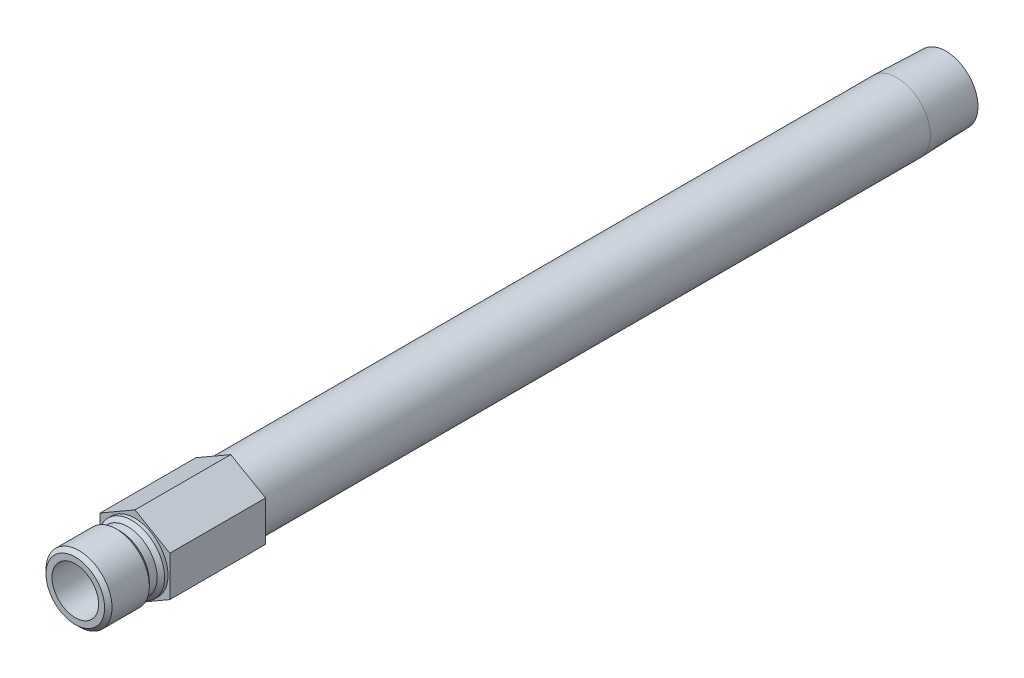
ISO-10303-21;
HEADER;
FILE_DESCRIPTION(('STEP AP214'),'2;1');
FILE_NAME('part.step','',(''),(''),'','','');
FILE_SCHEMA(('AUTOMOTIVE_DESIGN { 1 0 10303 214 1 1 1 1 }'));
ENDSEC;
DATA;
#1=APPLICATION_CONTEXT('core data for automotive mechanical design processes');
#2=APPLICATION_PROTOCOL_DEFINITION('international standard','automotive_design',2000,#1);
#3=PRODUCT_CONTEXT('',#1,'mechanical');
#4=PRODUCT('Part','Part','',(#3));
#5=PRODUCT_RELATED_PRODUCT_CATEGORY('part','',(#4));
#6=PRODUCT_DEFINITION_FORMATION('','',#4);
#7=PRODUCT_DEFINITION_CONTEXT('part definition',#1,'design');
#8=PRODUCT_DEFINITION('design','',#6,#7);
#9=PRODUCT_DEFINITION_SHAPE('','',#8);
#10=(LENGTH_UNIT() NAMED_UNIT(*) SI_UNIT(.MILLI.,.METRE.));
#11=(NAMED_UNIT(*) PLANE_ANGLE_UNIT() SI_UNIT($,.RADIAN.));
#12=(NAMED_UNIT(*) SI_UNIT($,.STERADIAN.) SOLID_ANGLE_UNIT());
#13=UNCERTAINTY_MEASURE_WITH_UNIT(LENGTH_MEASURE(1.E-05),#10,'distance_accuracy_value','');
#14=(GEOMETRIC_REPRESENTATION_CONTEXT(3) GLOBAL_UNCERTAINTY_ASSIGNED_CONTEXT((#13)) GLOBAL_UNIT_ASSIGNED_CONTEXT((#10,
#11,#12)) REPRESENTATION_CONTEXT('',''));
#15=CARTESIAN_POINT('',(0.,0.,0.));
#16=DIRECTION('',(0.,0.,1.));
#17=DIRECTION('',(1.,0.,0.));
#18=AXIS2_PLACEMENT_3D('',#15,#16,#17);
#19=CARTESIAN_POINT('',(0.,0.,0.));
#20=DIRECTION('',(0.,0.,-1.));
#21=DIRECTION('',(0.,1.,0.));
#22=AXIS2_PLACEMENT_3D('',#19,#20,#21);
#23=CYLINDRICAL_SURFACE('',#22,4.7625);
#24=CARTESIAN_POINT('',(0.,0.,0.));
#25=DIRECTION('',(0.,0.,1.));
#26=DIRECTION('',(1.,0.,0.));
#27=AXIS2_PLACEMENT_3D('',#24,#25,#26);
#28=CIRCLE('',#27,4.7625);
#29=CARTESIAN_POINT('',(4.7625,0.,0.));
#30=VERTEX_POINT('',#29);
#31=EDGE_CURVE('E138',#30,#30,#28,.T.);
#32=ORIENTED_EDGE('',*,*,#31,.F.);
#33=EDGE_LOOP('',(#32));
#34=FACE_BOUND('',#33,.T.);
#35=CARTESIAN_POINT('',(0.,0.,12.192));
#36=DIRECTION('',(0.,0.,-1.));
#37=DIRECTION('',(0.,1.,0.));
#38=AXIS2_PLACEMENT_3D('',#35,#36,#37);
#39=CIRCLE('',#38,4.7625);
#40=CARTESIAN_POINT('',(0.,4.7625,12.192));
#41=VERTEX_POINT('',#40);
#42=EDGE_CURVE('E11',#41,#41,#39,.T.);
#43=ORIENTED_EDGE('',*,*,#42,.F.);
#44=EDGE_LOOP('',(#43));
#45=FACE_BOUND('',#44,.T.);
#46=ADVANCED_FACE('F33',(#34,#45),#23,.F.);
#47=CARTESIAN_POINT('',(0.,4.7625,12.192));
#48=DIRECTION('',(0.,0.,1.));
#49=DIRECTION('',(0.,-1.,0.));
#50=AXIS2_PLACEMENT_3D('',#47,#48,#49);
#51=PLANE('',#50);
#52=ORIENTED_EDGE('',*,*,#42,.T.);
#53=EDGE_LOOP('',(#52));
#54=FACE_BOUND('',#53,.T.);
#55=CARTESIAN_POINT('',(0.,0.,12.192));
#56=DIRECTION('',(0.,0.,-1.));
#57=DIRECTION('',(0.,1.,0.));
#58=AXIS2_PLACEMENT_3D('',#55,#56,#57);
#59=CIRCLE('',#58,5.9817);
#60=CARTESIAN_POINT('',(0.,5.9817,12.192));
#61=VERTEX_POINT('',#60);
#62=EDGE_CURVE('E41',#61,#61,#59,.T.);
#63=ORIENTED_EDGE('',*,*,#62,.F.);
#64=EDGE_LOOP('',(#63));
#65=FACE_BOUND('',#64,.T.);
#66=ADVANCED_FACE('F181',(#54,#65),#51,.T.);
#67=CARTESIAN_POINT('',(0.,0.,11.43));
#68=DIRECTION('',(0.,0.,-1.));
#69=DIRECTION('',(0.,1.,0.));
#70=AXIS2_PLACEMENT_3D('',#67,#68,#69);
#71=CONICAL_SURFACE('',#70,6.7437,0.785398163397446);
#72=ORIENTED_EDGE('',*,*,#62,.T.);
#73=EDGE_LOOP('',(#72));
#74=FACE_BOUND('',#73,.T.);
#75=CARTESIAN_POINT('',(0.,0.,11.43));
#76=DIRECTION('',(0.,0.,-1.));
#77=DIRECTION('',(0.,1.,0.));
#78=AXIS2_PLACEMENT_3D('',#75,#76,#77);
#79=CIRCLE('',#78,6.7437);
#80=CARTESIAN_POINT('',(0.,6.7437,11.43));
#81=VERTEX_POINT('',#80);
#82=EDGE_CURVE('E173',#81,#81,#79,.T.);
#83=ORIENTED_EDGE('',*,*,#82,.F.);
#84=EDGE_LOOP('',(#83));
#85=FACE_BOUND('',#84,.T.);
#86=ADVANCED_FACE('F178',(#74,#85),#71,.T.);
#87=CARTESIAN_POINT('',(0.,0.,0.));
#88=DIRECTION('',(0.,0.,-1.));
#89=DIRECTION('',(0.,1.,0.));
#90=AXIS2_PLACEMENT_3D('',#87,#88,#89);
#91=CYLINDRICAL_SURFACE('',#90,6.7437);
#92=ORIENTED_EDGE('',*,*,#82,.T.);
#93=EDGE_LOOP('',(#92));
#94=FACE_BOUND('',#93,.T.);
#95=CARTESIAN_POINT('',(0.,0.,3.81));
#96=DIRECTION('',(0.,0.,-1.));
#97=DIRECTION('',(0.,1.,0.));
#98=AXIS2_PLACEMENT_3D('',#95,#96,#97);
#99=CIRCLE('',#98,6.7437);
#100=CARTESIAN_POINT('',(0.,6.7437,3.81));
#101=VERTEX_POINT('',#100);
#102=EDGE_CURVE('E170',#101,#101,#99,.T.);
#103=ORIENTED_EDGE('',*,*,#102,.F.);
#104=EDGE_LOOP('',(#103));
#105=FACE_BOUND('',#104,.T.);
#106=ADVANCED_FACE('F188',(#94,#105),#91,.T.);
#107=CARTESIAN_POINT('',(0.,0.,3.048));
#108=DIRECTION('',(0.,0.,1.));
#109=DIRECTION('',(0.,-1.,0.));
#110=AXIS2_PLACEMENT_3D('',#107,#108,#109);
#111=CONICAL_SURFACE('',#110,5.9817,0.785398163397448);
#112=ORIENTED_EDGE('',*,*,#102,.T.);
#113=EDGE_LOOP('',(#112));
#114=FACE_BOUND('',#113,.T.);
#115=CARTESIAN_POINT('',(0.,0.,3.048));
#116=DIRECTION('',(0.,0.,-1.));
#117=DIRECTION('',(0.,1.,0.));
#118=AXIS2_PLACEMENT_3D('',#115,#116,#117);
#119=CIRCLE('',#118,5.9817);
#120=CARTESIAN_POINT('',(0.,5.9817,3.048));
#121=VERTEX_POINT('',#120);
#122=EDGE_CURVE('E167',#121,#121,#119,.T.);
#123=ORIENTED_EDGE('',*,*,#122,.F.);
#124=EDGE_LOOP('',(#123));
#125=FACE_BOUND('',#124,.T.);
#126=ADVANCED_FACE('F194',(#114,#125),#111,.T.);
#127=CARTESIAN_POINT('',(0.,0.,0.));
#128=DIRECTION('',(0.,0.,-1.));
#129=DIRECTION('',(0.,1.,0.));
#130=AXIS2_PLACEMENT_3D('',#127,#128,#129);
#131=CYLINDRICAL_SURFACE('',#130,5.9817);
#132=ORIENTED_EDGE('',*,*,#122,.T.);
#133=EDGE_LOOP('',(#132));
#134=FACE_BOUND('',#133,.T.);
#135=CARTESIAN_POINT('',(0.,0.,1.4605));
#136=DIRECTION('',(0.,0.,-1.));
#137=DIRECTION('',(0.,1.,0.));
#138=AXIS2_PLACEMENT_3D('',#135,#136,#137);
#139=CIRCLE('',#138,5.9817);
#140=CARTESIAN_POINT('',(0.,5.9817,1.4605));
#141=VERTEX_POINT('',#140);
#142=EDGE_CURVE('E164',#141,#141,#139,.T.);
#143=ORIENTED_EDGE('',*,*,#142,.F.);
#144=EDGE_LOOP('',(#143));
#145=FACE_BOUND('',#144,.T.);
#146=ADVANCED_FACE('F198',(#134,#145),#131,.T.);
#147=CARTESIAN_POINT('',(0.,0.,0.698499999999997));
#148=DIRECTION('',(0.,0.,-1.));
#149=DIRECTION('',(0.,1.,0.));
#150=AXIS2_PLACEMENT_3D('',#147,#148,#149);
#151=CONICAL_SURFACE('',#150,6.7437,0.785398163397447);
#152=ORIENTED_EDGE('',*,*,#142,.T.);
#153=EDGE_LOOP('',(#152));
#154=FACE_BOUND('',#153,.T.);
#155=CARTESIAN_POINT('',(0.,0.,0.698499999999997));
#156=DIRECTION('',(0.,0.,-1.));
#157=DIRECTION('',(0.,1.,0.));
#158=AXIS2_PLACEMENT_3D('',#155,#156,#157);
#159=CIRCLE('',#158,6.7437);
#160=CARTESIAN_POINT('',(0.,6.7437,0.698499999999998));
#161=VERTEX_POINT('',#160);
#162=EDGE_CURVE('E161',#161,#161,#159,.T.);
#163=ORIENTED_EDGE('',*,*,#162,.F.);
#164=EDGE_LOOP('',(#163));
#165=FACE_BOUND('',#164,.T.);
#166=ADVANCED_FACE('F202',(#154,#165),#151,.T.);
#167=CARTESIAN_POINT('',(0.,0.,0.));
#168=DIRECTION('',(0.,0.,-1.));
#169=DIRECTION('',(0.,1.,0.));
#170=AXIS2_PLACEMENT_3D('',#167,#168,#169);
#171=CYLINDRICAL_SURFACE('',#170,6.7437);
#172=ORIENTED_EDGE('',*,*,#162,.T.);
#173=EDGE_LOOP('',(#172));
#174=FACE_BOUND('',#173,.T.);
#175=CARTESIAN_POINT('',(0.,0.,0.));
#176=DIRECTION('',(0.,0.,-1.));
#177=DIRECTION('',(0.,1.,0.));
#178=AXIS2_PLACEMENT_3D('',#175,#176,#177);
#179=CIRCLE('',#178,6.7437);
#180=CARTESIAN_POINT('',(0.,6.7437,0.));
#181=VERTEX_POINT('',#180);
#182=EDGE_CURVE('E158',#181,#181,#179,.T.);
#183=ORIENTED_EDGE('',*,*,#182,.F.);
#184=EDGE_LOOP('',(#183));
#185=FACE_BOUND('',#184,.T.);
#186=ADVANCED_FACE('F206',(#174,#185),#171,.T.);
#187=CARTESIAN_POINT('',(0.,6.7437,0.));
#188=DIRECTION('',(0.,0.,1.));
#189=DIRECTION('',(0.,-1.,0.));
#190=AXIS2_PLACEMENT_3D('',#187,#188,#189);
#191=PLANE('',#190);
#192=ORIENTED_EDGE('',*,*,#182,.T.);
#193=EDGE_LOOP('',(#192));
#194=FACE_BOUND('',#193,.T.);
#195=DIRECTION('',(-0.866025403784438,-0.5,0.));
#196=VECTOR('',#195,1.);
#197=CARTESIAN_POINT('',(0.,8.21223022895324,0.));
#198=LINE('',#197,#196);
#199=CARTESIAN_POINT('',(0.,8.21223022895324,0.));
#200=VERTEX_POINT('',#199);
#201=CARTESIAN_POINT('',(-7.112,4.10611511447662,0.));
#202=VERTEX_POINT('',#201);
#203=EDGE_CURVE('E120',#200,#202,#198,.T.);
#204=ORIENTED_EDGE('',*,*,#203,.T.);
#205=DIRECTION('',(0.,-1.,0.));
#206=VECTOR('',#205,1.);
#207=CARTESIAN_POINT('',(-7.112,4.10611511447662,0.));
#208=LINE('',#207,#206);
#209=CARTESIAN_POINT('',(-7.112,-4.10611511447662,0.));
#210=VERTEX_POINT('',#209);
#211=EDGE_CURVE('E123',#202,#210,#208,.T.);
#212=ORIENTED_EDGE('',*,*,#211,.T.);
#213=DIRECTION('',(0.866025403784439,-0.5,0.));
#214=VECTOR('',#213,1.);
#215=CARTESIAN_POINT('',(-7.112,-4.10611511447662,0.));
#216=LINE('',#215,#214);
#217=CARTESIAN_POINT('',(0.,-8.21223022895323,0.));
#218=VERTEX_POINT('',#217);
#219=EDGE_CURVE('E127',#210,#218,#216,.T.);
#220=ORIENTED_EDGE('',*,*,#219,.T.);
#221=DIRECTION('',(0.866025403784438,0.5,0.));
#222=VECTOR('',#221,1.);
#223=CARTESIAN_POINT('',(0.,-8.21223022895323,0.));
#224=LINE('',#223,#222);
#225=CARTESIAN_POINT('',(7.112,-4.10611511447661,0.));
#226=VERTEX_POINT('',#225);
#227=EDGE_CURVE('E130',#218,#226,#224,.T.);
#228=ORIENTED_EDGE('',*,*,#227,.T.);
#229=DIRECTION('',(0.,1.,0.));
#230=VECTOR('',#229,1.);
#231=CARTESIAN_POINT('',(7.112,-4.10611511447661,0.));
#232=LINE('',#231,#230);
#233=CARTESIAN_POINT('',(7.112,4.10611511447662,0.));
#234=VERTEX_POINT('',#233);
#235=EDGE_CURVE('E97',#226,#234,#232,.T.);
#236=ORIENTED_EDGE('',*,*,#235,.T.);
#237=DIRECTION('',(-0.866025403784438,0.5,0.));
#238=VECTOR('',#237,1.);
#239=CARTESIAN_POINT('',(7.112,4.10611511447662,0.));
#240=LINE('',#239,#238);
#241=EDGE_CURVE('E133',#234,#200,#240,.T.);
#242=ORIENTED_EDGE('',*,*,#241,.T.);
#243=EDGE_LOOP('',(#204,#212,#220,#228,#236,#242));
#244=FACE_BOUND('',#243,.T.);
#245=ADVANCED_FACE('F210',(#194,#244),#191,.T.);
#246=CARTESIAN_POINT('',(-7.112,4.10611511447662,0.));
#247=DIRECTION('',(0.,0.,1.));
#248=DIRECTION('',(1.,0.,0.));
#249=AXIS2_PLACEMENT_3D('',#246,#247,#248);
#250=PLANE('',#249);
#251=ORIENTED_EDGE('',*,*,#31,.T.);
#252=EDGE_LOOP('',(#251));
#253=FACE_BOUND('',#252,.T.);
#254=CARTESIAN_POINT('',(0.,0.,0.));
#255=DIRECTION('',(0.,0.,1.));
#256=DIRECTION('',(1.,0.,0.));
#257=AXIS2_PLACEMENT_3D('',#254,#255,#256);
#258=CIRCLE('',#257,4.62279999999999);
#259=CARTESIAN_POINT('',(4.62279999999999,0.,0.));
#260=VERTEX_POINT('',#259);
#261=EDGE_CURVE('E124',#260,#260,#258,.T.);
#262=ORIENTED_EDGE('',*,*,#261,.F.);
#263=EDGE_LOOP('',(#262));
#264=FACE_BOUND('',#263,.T.);
#265=ADVANCED_FACE('F214',(#253,#264),#250,.T.);
#266=CARTESIAN_POINT('',(0.,0.,-165.608));
#267=DIRECTION('',(0.,0.,1.));
#268=DIRECTION('',(0.,-1.,0.));
#269=AXIS2_PLACEMENT_3D('',#266,#267,#268);
#270=CONICAL_SURFACE('',#269,6.54447060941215,0.0312396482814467);
#271=CARTESIAN_POINT('',(0.,0.,-155.575));
#272=DIRECTION('',(0.,0.,-1.));
#273=DIRECTION('',(0.,1.,0.));
#274=AXIS2_PLACEMENT_3D('',#271,#272,#273);
#275=CIRCLE('',#274,6.85799999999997);
#276=CARTESIAN_POINT('',(0.,6.858,-155.575));
#277=VERTEX_POINT('',#276);
#278=EDGE_CURVE('E155',#277,#277,#275,.T.);
#279=ORIENTED_EDGE('',*,*,#278,.T.);
#280=EDGE_LOOP('',(#279));
#281=FACE_BOUND('',#280,.T.);
#282=CARTESIAN_POINT('',(0.,0.,-165.608));
#283=DIRECTION('',(0.,0.,-1.));
#284=DIRECTION('',(0.,1.,0.));
#285=AXIS2_PLACEMENT_3D('',#282,#283,#284);
#286=CIRCLE('',#285,6.54447060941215);
#287=CARTESIAN_POINT('',(0.,6.54447060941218,-165.608));
#288=VERTEX_POINT('',#287);
#289=EDGE_CURVE('E152',#288,#288,#286,.T.);
#290=ORIENTED_EDGE('',*,*,#289,.F.);
#291=EDGE_LOOP('',(#290));
#292=FACE_BOUND('',#291,.T.);
#293=ADVANCED_FACE('F220',(#281,#292),#270,.T.);
#294=CARTESIAN_POINT('',(0.,0.,0.));
#295=DIRECTION('',(0.,0.,-1.));
#296=DIRECTION('',(0.,1.,0.));
#297=AXIS2_PLACEMENT_3D('',#294,#295,#296);
#298=CYLINDRICAL_SURFACE('',#297,6.85799999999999);
#299=ORIENTED_EDGE('',*,*,#278,.F.);
#300=EDGE_LOOP('',(#299));
#301=FACE_BOUND('',#300,.T.);
#302=CARTESIAN_POINT('',(0.,0.,-19.558));
#303=DIRECTION('',(0.,0.,1.));
#304=DIRECTION('',(1.,0.,0.));
#305=AXIS2_PLACEMENT_3D('',#302,#303,#304);
#306=CIRCLE('',#305,6.85799999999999);
#307=CARTESIAN_POINT('',(6.85799999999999,0.,-19.558));
#308=VERTEX_POINT('',#307);
#309=EDGE_CURVE('E146',#308,#308,#306,.F.);
#310=ORIENTED_EDGE('',*,*,#309,.T.);
#311=EDGE_LOOP('',(#310));
#312=FACE_BOUND('',#311,.T.);
#313=ADVANCED_FACE('F216',(#301,#312),#298,.T.);
#314=CARTESIAN_POINT('',(0.,6.54447060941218,-165.608));
#315=DIRECTION('',(0.,0.,-1.));
#316=DIRECTION('',(0.,1.,0.));
#317=AXIS2_PLACEMENT_3D('',#314,#315,#316);
#318=PLANE('',#317);
#319=ORIENTED_EDGE('',*,*,#289,.T.);
#320=EDGE_LOOP('',(#319));
#321=FACE_BOUND('',#320,.T.);
#322=CARTESIAN_POINT('',(0.,0.,-165.608));
#323=DIRECTION('',(0.,0.,-1.));
#324=DIRECTION('',(0.,1.,0.));
#325=AXIS2_PLACEMENT_3D('',#322,#323,#324);
#326=CIRCLE('',#325,4.62279999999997);
#327=CARTESIAN_POINT('',(0.,4.6228,-165.608));
#328=VERTEX_POINT('',#327);
#329=EDGE_CURVE('E149',#328,#328,#326,.T.);
#330=ORIENTED_EDGE('',*,*,#329,.F.);
#331=EDGE_LOOP('',(#330));
#332=FACE_BOUND('',#331,.T.);
#333=ADVANCED_FACE('F219',(#321,#332),#318,.T.);
#334=CARTESIAN_POINT('',(0.,0.,0.));
#335=DIRECTION('',(0.,0.,-1.));
#336=DIRECTION('',(0.,1.,0.));
#337=AXIS2_PLACEMENT_3D('',#334,#335,#336);
#338=CYLINDRICAL_SURFACE('',#337,4.62279999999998);
#339=ORIENTED_EDGE('',*,*,#261,.T.);
#340=EDGE_LOOP('',(#339));
#341=FACE_BOUND('',#340,.T.);
#342=ORIENTED_EDGE('',*,*,#329,.T.);
#343=EDGE_LOOP('',(#342));
#344=FACE_BOUND('',#343,.T.);
#345=ADVANCED_FACE('F227',(#341,#344),#338,.F.);
#346=CARTESIAN_POINT('',(0.,8.21223022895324,-19.558));
#347=DIRECTION('',(-0.5,0.866025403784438,0.));
#348=DIRECTION('',(-0.866025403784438,-0.5,0.));
#349=AXIS2_PLACEMENT_3D('',#346,#347,#348);
#350=PLANE('',#349);
#351=ORIENTED_EDGE('',*,*,#203,.F.);
#352=DIRECTION('',(0.,0.,1.));
#353=VECTOR('',#352,1.);
#354=CARTESIAN_POINT('',(0.,8.21223022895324,-19.558));
#355=LINE('',#354,#353);
#356=CARTESIAN_POINT('',(0.,8.21223022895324,-19.558));
#357=VERTEX_POINT('',#356);
#358=EDGE_CURVE('E49',#357,#200,#355,.T.);
#359=ORIENTED_EDGE('',*,*,#358,.F.);
#360=DIRECTION('',(-0.866025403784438,-0.5,0.));
#361=VECTOR('',#360,1.);
#362=CARTESIAN_POINT('',(0.,8.21223022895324,-19.558));
#363=LINE('',#362,#361);
#364=CARTESIAN_POINT('',(-7.112,4.10611511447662,-19.558));
#365=VERTEX_POINT('',#364);
#366=EDGE_CURVE('E136',#357,#365,#363,.T.);
#367=ORIENTED_EDGE('',*,*,#366,.T.);
#368=DIRECTION('',(0.,0.,1.));
#369=VECTOR('',#368,1.);
#370=CARTESIAN_POINT('',(-7.112,4.10611511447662,-19.558));
#371=LINE('',#370,#369);
#372=EDGE_CURVE('E84',#365,#202,#371,.T.);
#373=ORIENTED_EDGE('',*,*,#372,.T.);
#374=EDGE_LOOP('',(#351,#359,#367,#373));
#375=FACE_BOUND('',#374,.T.);
#376=ADVANCED_FACE('F231',(#375),#350,.T.);
#377=CARTESIAN_POINT('',(7.112,4.10611511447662,-19.558));
#378=DIRECTION('',(0.5,0.866025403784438,0.));
#379=DIRECTION('',(-0.866025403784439,0.5,0.));
#380=AXIS2_PLACEMENT_3D('',#377,#378,#379);
#381=PLANE('',#380);
#382=ORIENTED_EDGE('',*,*,#241,.F.);
#383=DIRECTION('',(0.,0.,1.));
#384=VECTOR('',#383,1.);
#385=CARTESIAN_POINT('',(7.112,4.10611511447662,-19.558));
#386=LINE('',#385,#384);
#387=CARTESIAN_POINT('',(7.112,4.10611511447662,-19.558));
#388=VERTEX_POINT('',#387);
#389=EDGE_CURVE('E72',#388,#234,#386,.T.);
#390=ORIENTED_EDGE('',*,*,#389,.F.);
#391=DIRECTION('',(-0.866025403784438,0.5,0.));
#392=VECTOR('',#391,1.);
#393=CARTESIAN_POINT('',(7.112,4.10611511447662,-19.558));
#394=LINE('',#393,#392);
#395=EDGE_CURVE('E110',#388,#357,#394,.T.);
#396=ORIENTED_EDGE('',*,*,#395,.T.);
#397=ORIENTED_EDGE('',*,*,#358,.T.);
#398=EDGE_LOOP('',(#382,#390,#396,#397));
#399=FACE_BOUND('',#398,.T.);
#400=ADVANCED_FACE('F235',(#399),#381,.T.);
#401=CARTESIAN_POINT('',(7.112,-4.10611511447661,-19.558));
#402=DIRECTION('',(1.,0.,0.));
#403=DIRECTION('',(0.,1.,0.));
#404=AXIS2_PLACEMENT_3D('',#401,#402,#403);
#405=PLANE('',#404);
#406=ORIENTED_EDGE('',*,*,#235,.F.);
#407=DIRECTION('',(0.,0.,1.));
#408=VECTOR('',#407,1.);
#409=CARTESIAN_POINT('',(7.112,-4.10611511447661,-19.558));
#410=LINE('',#409,#408);
#411=CARTESIAN_POINT('',(7.112,-4.10611511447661,-19.558));
#412=VERTEX_POINT('',#411);
#413=EDGE_CURVE('E92',#412,#226,#410,.T.);
#414=ORIENTED_EDGE('',*,*,#413,.F.);
#415=DIRECTION('',(0.,1.,0.));
#416=VECTOR('',#415,1.);
#417=CARTESIAN_POINT('',(7.112,-4.10611511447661,-19.558));
#418=LINE('',#417,#416);
#419=EDGE_CURVE('E95',#412,#388,#418,.T.);
#420=ORIENTED_EDGE('',*,*,#419,.T.);
#421=ORIENTED_EDGE('',*,*,#389,.T.);
#422=EDGE_LOOP('',(#406,#414,#420,#421));
#423=FACE_BOUND('',#422,.T.);
#424=ADVANCED_FACE('F94',(#423),#405,.T.);
#425=CARTESIAN_POINT('',(0.,-8.21223022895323,-19.558));
#426=DIRECTION('',(0.5,-0.866025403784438,0.));
#427=DIRECTION('',(0.866025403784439,0.5,0.));
#428=AXIS2_PLACEMENT_3D('',#425,#426,#427);
#429=PLANE('',#428);
#430=ORIENTED_EDGE('',*,*,#227,.F.);
#431=DIRECTION('',(0.,0.,1.));
#432=VECTOR('',#431,1.);
#433=CARTESIAN_POINT('',(0.,-8.21223022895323,-19.558));
#434=LINE('',#433,#432);
#435=CARTESIAN_POINT('',(0.,-8.21223022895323,-19.558));
#436=VERTEX_POINT('',#435);
#437=EDGE_CURVE('E102',#436,#218,#434,.T.);
#438=ORIENTED_EDGE('',*,*,#437,.F.);
#439=DIRECTION('',(0.866025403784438,0.5,0.));
#440=VECTOR('',#439,1.);
#441=CARTESIAN_POINT('',(0.,-8.21223022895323,-19.558));
#442=LINE('',#441,#440);
#443=EDGE_CURVE('E108',#436,#412,#442,.T.);
#444=ORIENTED_EDGE('',*,*,#443,.T.);
#445=ORIENTED_EDGE('',*,*,#413,.T.);
#446=EDGE_LOOP('',(#430,#438,#444,#445));
#447=FACE_BOUND('',#446,.T.);
#448=ADVANCED_FACE('F112',(#447),#429,.T.);
#449=CARTESIAN_POINT('',(-7.112,-4.10611511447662,-19.558));
#450=DIRECTION('',(-0.5,-0.866025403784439,0.));
#451=DIRECTION('',(0.866025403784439,-0.5,0.));
#452=AXIS2_PLACEMENT_3D('',#449,#450,#451);
#453=PLANE('',#452);
#454=ORIENTED_EDGE('',*,*,#219,.F.);
#455=DIRECTION('',(0.,0.,1.));
#456=VECTOR('',#455,1.);
#457=CARTESIAN_POINT('',(-7.112,-4.10611511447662,-19.558));
#458=LINE('',#457,#456);
#459=CARTESIAN_POINT('',(-7.112,-4.10611511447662,-19.558));
#460=VERTEX_POINT('',#459);
#461=EDGE_CURVE('E141',#460,#210,#458,.T.);
#462=ORIENTED_EDGE('',*,*,#461,.F.);
#463=DIRECTION('',(0.866025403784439,-0.5,0.));
#464=VECTOR('',#463,1.);
#465=CARTESIAN_POINT('',(-7.112,-4.10611511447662,-19.558));
#466=LINE('',#465,#464);
#467=EDGE_CURVE('E113',#460,#436,#466,.T.);
#468=ORIENTED_EDGE('',*,*,#467,.T.);
#469=ORIENTED_EDGE('',*,*,#437,.T.);
#470=EDGE_LOOP('',(#454,#462,#468,#469));
#471=FACE_BOUND('',#470,.T.);
#472=ADVANCED_FACE('F239',(#471),#453,.T.);
#473=CARTESIAN_POINT('',(-7.112,4.10611511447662,-19.558));
#474=DIRECTION('',(-1.,0.,0.));
#475=DIRECTION('',(0.,-1.,0.));
#476=AXIS2_PLACEMENT_3D('',#473,#474,#475);
#477=PLANE('',#476);
#478=ORIENTED_EDGE('',*,*,#211,.F.);
#479=ORIENTED_EDGE('',*,*,#372,.F.);
#480=DIRECTION('',(0.,-1.,0.));
#481=VECTOR('',#480,1.);
#482=CARTESIAN_POINT('',(-7.112,4.10611511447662,-19.558));
#483=LINE('',#482,#481);
#484=EDGE_CURVE('E115',#365,#460,#483,.T.);
#485=ORIENTED_EDGE('',*,*,#484,.T.);
#486=ORIENTED_EDGE('',*,*,#461,.T.);
#487=EDGE_LOOP('',(#478,#479,#485,#486));
#488=FACE_BOUND('',#487,.T.);
#489=ADVANCED_FACE('F236',(#488),#477,.T.);
#490=CARTESIAN_POINT('',(-7.112,4.10611511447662,-19.558));
#491=DIRECTION('',(0.,0.,1.));
#492=DIRECTION('',(1.,0.,0.));
#493=AXIS2_PLACEMENT_3D('',#490,#491,#492);
#494=PLANE('',#493);
#495=ORIENTED_EDGE('',*,*,#309,.F.);
#496=EDGE_LOOP('',(#495));
#497=FACE_BOUND('',#496,.T.);
#498=ORIENTED_EDGE('',*,*,#366,.F.);
#499=ORIENTED_EDGE('',*,*,#395,.F.);
#500=ORIENTED_EDGE('',*,*,#419,.F.);
#501=ORIENTED_EDGE('',*,*,#443,.F.);
#502=ORIENTED_EDGE('',*,*,#467,.F.);
#503=ORIENTED_EDGE('',*,*,#484,.F.);
#504=EDGE_LOOP('',(#498,#499,#500,#501,#502,#503));
#505=FACE_BOUND('',#504,.T.);
#506=ADVANCED_FACE('F106',(#497,#505),#494,.F.);
#507=CLOSED_SHELL('',(#46,#66,#86,#106,#126,#146,#166,#186,#245,#265,#293,#313,#333,#345,#376,
#400,#424,#448,#472,#489,#506));
#508=MANIFOLD_SOLID_BREP('B2',#507);
#509=ADVANCED_BREP_SHAPE_REPRESENTATION('',(#18,#508),#14);
#510=SHAPE_DEFINITION_REPRESENTATION(#9,#509);
ENDSEC;
END-ISO-10303-21;
